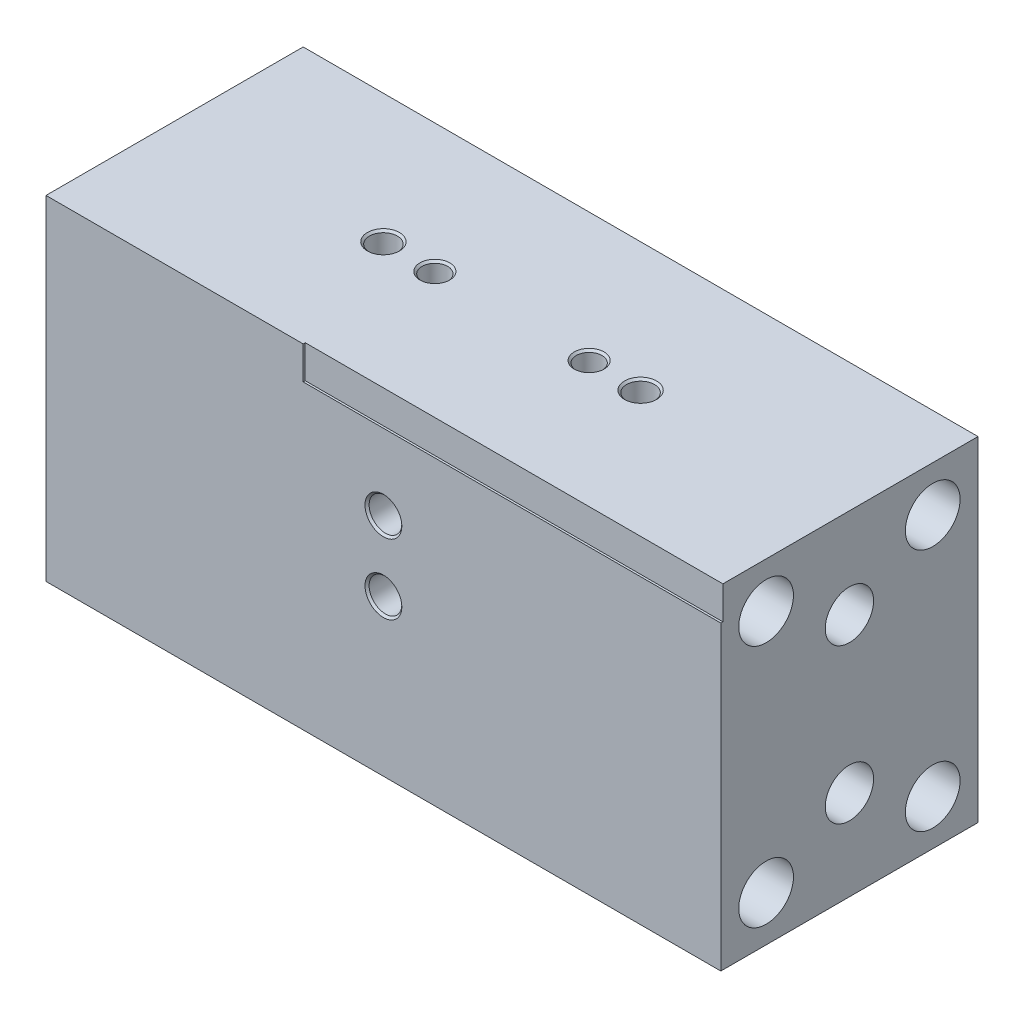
ISO-10303-21;
HEADER;
FILE_DESCRIPTION(('STEP AP214'),'2;1');
FILE_NAME('part.step','',(''),(''),'','','');
FILE_SCHEMA(('AUTOMOTIVE_DESIGN { 1 0 10303 214 1 1 1 1 }'));
ENDSEC;
DATA;
#1=APPLICATION_CONTEXT('core data for automotive mechanical design processes');
#2=APPLICATION_PROTOCOL_DEFINITION('international standard','automotive_design',2000,#1);
#3=PRODUCT_CONTEXT('',#1,'mechanical');
#4=PRODUCT('Part','Part','',(#3));
#5=PRODUCT_RELATED_PRODUCT_CATEGORY('part','',(#4));
#6=PRODUCT_DEFINITION_FORMATION('','',#4);
#7=PRODUCT_DEFINITION_CONTEXT('part definition',#1,'design');
#8=PRODUCT_DEFINITION('design','',#6,#7);
#9=PRODUCT_DEFINITION_SHAPE('','',#8);
#10=(LENGTH_UNIT() NAMED_UNIT(*) SI_UNIT(.MILLI.,.METRE.));
#11=(NAMED_UNIT(*) PLANE_ANGLE_UNIT() SI_UNIT($,.RADIAN.));
#12=(NAMED_UNIT(*) SI_UNIT($,.STERADIAN.) SOLID_ANGLE_UNIT());
#13=UNCERTAINTY_MEASURE_WITH_UNIT(LENGTH_MEASURE(1.E-05),#10,'distance_accuracy_value','');
#14=(GEOMETRIC_REPRESENTATION_CONTEXT(3) GLOBAL_UNCERTAINTY_ASSIGNED_CONTEXT((#13)) GLOBAL_UNIT_ASSIGNED_CONTEXT((#10,
#11,#12)) REPRESENTATION_CONTEXT('',''));
#15=CARTESIAN_POINT('',(0.,0.,0.));
#16=DIRECTION('',(0.,0.,1.));
#17=DIRECTION('',(1.,0.,0.));
#18=AXIS2_PLACEMENT_3D('',#15,#16,#17);
#19=CARTESIAN_POINT('',(-41.656,20.6375,15.875));
#20=DIRECTION('',(1.,0.,0.));
#21=DIRECTION('',(0.,0.,-1.));
#22=AXIS2_PLACEMENT_3D('',#19,#20,#21);
#23=PLANE('',#22);
#24=CARTESIAN_POINT('',(-41.656,-9.525,0.));
#25=DIRECTION('',(1.,0.,0.));
#26=DIRECTION('',(0.,0.,-1.));
#27=AXIS2_PLACEMENT_3D('',#24,#25,#26);
#28=CIRCLE('',#27,2.9845);
#29=CARTESIAN_POINT('',(-41.656,-9.525,-2.9845));
#30=VERTEX_POINT('',#29);
#31=EDGE_CURVE('E451',#30,#30,#28,.T.);
#32=ORIENTED_EDGE('',*,*,#31,.T.);
#33=EDGE_LOOP('',(#32));
#34=FACE_BOUND('',#33,.T.);
#35=CARTESIAN_POINT('',(-41.656,9.525,0.));
#36=DIRECTION('',(1.,0.,0.));
#37=DIRECTION('',(0.,0.,-1.));
#38=AXIS2_PLACEMENT_3D('',#35,#36,#37);
#39=CIRCLE('',#38,2.9845);
#40=CARTESIAN_POINT('',(-41.656,9.525,-2.9845));
#41=VERTEX_POINT('',#40);
#42=EDGE_CURVE('E221',#41,#41,#39,.T.);
#43=ORIENTED_EDGE('',*,*,#42,.T.);
#44=EDGE_LOOP('',(#43));
#45=FACE_BOUND('',#44,.T.);
#46=CARTESIAN_POINT('',(-41.656,-15.0495,-10.287));
#47=DIRECTION('',(1.,0.,0.));
#48=DIRECTION('',(0.,0.,-1.));
#49=AXIS2_PLACEMENT_3D('',#46,#47,#48);
#50=CIRCLE('',#49,3.3782);
#51=CARTESIAN_POINT('',(-41.656,-15.0495,-13.6652));
#52=VERTEX_POINT('',#51);
#53=EDGE_CURVE('E246',#52,#52,#50,.T.);
#54=ORIENTED_EDGE('',*,*,#53,.T.);
#55=EDGE_LOOP('',(#54));
#56=FACE_BOUND('',#55,.T.);
#57=CARTESIAN_POINT('',(-41.656,-15.0495,10.287));
#58=DIRECTION('',(1.,0.,0.));
#59=DIRECTION('',(0.,0.,-1.));
#60=AXIS2_PLACEMENT_3D('',#57,#58,#59);
#61=CIRCLE('',#60,3.3782);
#62=CARTESIAN_POINT('',(-41.656,-15.0495,6.9088));
#63=VERTEX_POINT('',#62);
#64=EDGE_CURVE('E493',#63,#63,#61,.T.);
#65=ORIENTED_EDGE('',*,*,#64,.T.);
#66=EDGE_LOOP('',(#65));
#67=FACE_BOUND('',#66,.T.);
#68=CARTESIAN_POINT('',(-41.656,15.0495,-10.287));
#69=DIRECTION('',(1.,0.,0.));
#70=DIRECTION('',(0.,0.,-1.));
#71=AXIS2_PLACEMENT_3D('',#68,#69,#70);
#72=CIRCLE('',#71,3.3782);
#73=CARTESIAN_POINT('',(-41.656,15.0495,-13.6652));
#74=VERTEX_POINT('',#73);
#75=EDGE_CURVE('E488',#74,#74,#72,.T.);
#76=ORIENTED_EDGE('',*,*,#75,.T.);
#77=EDGE_LOOP('',(#76));
#78=FACE_BOUND('',#77,.T.);
#79=CARTESIAN_POINT('',(-41.656,15.0495,10.287));
#80=DIRECTION('',(1.,0.,0.));
#81=DIRECTION('',(0.,0.,-1.));
#82=AXIS2_PLACEMENT_3D('',#79,#80,#81);
#83=CIRCLE('',#82,3.3782);
#84=CARTESIAN_POINT('',(-41.656,15.0495,6.9088));
#85=VERTEX_POINT('',#84);
#86=EDGE_CURVE('E140',#85,#85,#83,.T.);
#87=ORIENTED_EDGE('',*,*,#86,.T.);
#88=EDGE_LOOP('',(#87));
#89=FACE_BOUND('',#88,.T.);
#90=DIRECTION('',(0.,-1.,0.));
#91=VECTOR('',#90,1.);
#92=CARTESIAN_POINT('',(-41.656,20.6375,-15.875));
#93=LINE('',#92,#91);
#94=CARTESIAN_POINT('',(-41.656,20.6375,-15.875));
#95=VERTEX_POINT('',#94);
#96=CARTESIAN_POINT('',(-41.656,-20.6375,-15.875));
#97=VERTEX_POINT('',#96);
#98=EDGE_CURVE('E184',#95,#97,#93,.T.);
#99=ORIENTED_EDGE('',*,*,#98,.T.);
#100=DIRECTION('',(0.,0.,-1.));
#101=VECTOR('',#100,1.);
#102=CARTESIAN_POINT('',(-41.656,-20.6375,15.875));
#103=LINE('',#102,#101);
#104=CARTESIAN_POINT('',(-41.656,-20.6375,15.875));
#105=VERTEX_POINT('',#104);
#106=EDGE_CURVE('E210',#105,#97,#103,.T.);
#107=ORIENTED_EDGE('',*,*,#106,.F.);
#108=DIRECTION('',(0.,-1.,0.));
#109=VECTOR('',#108,1.);
#110=CARTESIAN_POINT('',(-41.656,20.6375,15.875));
#111=LINE('',#110,#109);
#112=CARTESIAN_POINT('',(-41.656,20.6375,15.875));
#113=VERTEX_POINT('',#112);
#114=EDGE_CURVE('E188',#113,#105,#111,.T.);
#115=ORIENTED_EDGE('',*,*,#114,.F.);
#116=DIRECTION('',(0.,0.,-1.));
#117=VECTOR('',#116,1.);
#118=CARTESIAN_POINT('',(-41.656,20.6375,15.875));
#119=LINE('',#118,#117);
#120=EDGE_CURVE('E195',#113,#95,#119,.T.);
#121=ORIENTED_EDGE('',*,*,#120,.T.);
#122=EDGE_LOOP('',(#99,#107,#115,#121));
#123=FACE_BOUND('',#122,.T.);
#124=ADVANCED_FACE('F37',(#34,#45,#56,#67,#78,#89,#123),#23,.F.);
#125=CARTESIAN_POINT('',(-41.656,-20.6375,15.875));
#126=DIRECTION('',(0.,1.,0.));
#127=DIRECTION('',(0.,0.,1.));
#128=AXIS2_PLACEMENT_3D('',#125,#126,#127);
#129=PLANE('',#128);
#130=DIRECTION('',(1.,0.,0.));
#131=VECTOR('',#130,1.);
#132=CARTESIAN_POINT('',(-41.656,-20.6375,-15.875));
#133=LINE('',#132,#131);
#134=CARTESIAN_POINT('',(41.656,-20.6375,-15.875));
#135=VERTEX_POINT('',#134);
#136=EDGE_CURVE('E198',#97,#135,#133,.T.);
#137=ORIENTED_EDGE('',*,*,#136,.T.);
#138=DIRECTION('',(0.,0.,-1.));
#139=VECTOR('',#138,1.);
#140=CARTESIAN_POINT('',(41.656,-20.6375,15.875));
#141=LINE('',#140,#139);
#142=CARTESIAN_POINT('',(41.656,-20.6375,15.875));
#143=VERTEX_POINT('',#142);
#144=EDGE_CURVE('E207',#143,#135,#141,.T.);
#145=ORIENTED_EDGE('',*,*,#144,.F.);
#146=DIRECTION('',(1.,0.,0.));
#147=VECTOR('',#146,1.);
#148=CARTESIAN_POINT('',(-41.656,-20.6375,15.875));
#149=LINE('',#148,#147);
#150=EDGE_CURVE('E86',#105,#143,#149,.T.);
#151=ORIENTED_EDGE('',*,*,#150,.F.);
#152=ORIENTED_EDGE('',*,*,#106,.T.);
#153=EDGE_LOOP('',(#137,#145,#151,#152));
#154=FACE_BOUND('',#153,.T.);
#155=ADVANCED_FACE('F279',(#154),#129,.F.);
#156=CARTESIAN_POINT('',(41.656,-20.6375,15.875));
#157=DIRECTION('',(-1.,0.,0.));
#158=DIRECTION('',(0.,0.,1.));
#159=AXIS2_PLACEMENT_3D('',#156,#157,#158);
#160=PLANE('',#159);
#161=CARTESIAN_POINT('',(41.656,-9.525,0.));
#162=DIRECTION('',(1.,0.,0.));
#163=DIRECTION('',(0.,0.,-1.));
#164=AXIS2_PLACEMENT_3D('',#161,#162,#163);
#165=CIRCLE('',#164,2.9845);
#166=CARTESIAN_POINT('',(41.656,-9.525,-2.9845));
#167=VERTEX_POINT('',#166);
#168=EDGE_CURVE('E453',#167,#167,#165,.T.);
#169=ORIENTED_EDGE('',*,*,#168,.F.);
#170=EDGE_LOOP('',(#169));
#171=FACE_BOUND('',#170,.T.);
#172=CARTESIAN_POINT('',(41.656,9.525,0.));
#173=DIRECTION('',(1.,0.,0.));
#174=DIRECTION('',(0.,0.,-1.));
#175=AXIS2_PLACEMENT_3D('',#172,#173,#174);
#176=CIRCLE('',#175,2.9845);
#177=CARTESIAN_POINT('',(41.656,9.525,-2.9845));
#178=VERTEX_POINT('',#177);
#179=EDGE_CURVE('E244',#178,#178,#176,.T.);
#180=ORIENTED_EDGE('',*,*,#179,.F.);
#181=EDGE_LOOP('',(#180));
#182=FACE_BOUND('',#181,.T.);
#183=CARTESIAN_POINT('',(41.656,-15.0495,-10.287));
#184=DIRECTION('',(1.,0.,0.));
#185=DIRECTION('',(0.,0.,-1.));
#186=AXIS2_PLACEMENT_3D('',#183,#184,#185);
#187=CIRCLE('',#186,3.3782);
#188=CARTESIAN_POINT('',(41.656,-15.0495,-13.6652));
#189=VERTEX_POINT('',#188);
#190=EDGE_CURVE('E243',#189,#189,#187,.T.);
#191=ORIENTED_EDGE('',*,*,#190,.F.);
#192=EDGE_LOOP('',(#191));
#193=FACE_BOUND('',#192,.T.);
#194=CARTESIAN_POINT('',(41.656,-15.0495,10.287));
#195=DIRECTION('',(1.,0.,0.));
#196=DIRECTION('',(0.,0.,-1.));
#197=AXIS2_PLACEMENT_3D('',#194,#195,#196);
#198=CIRCLE('',#197,3.3782);
#199=CARTESIAN_POINT('',(41.656,-15.0495,6.9088));
#200=VERTEX_POINT('',#199);
#201=EDGE_CURVE('E467',#200,#200,#198,.T.);
#202=ORIENTED_EDGE('',*,*,#201,.F.);
#203=EDGE_LOOP('',(#202));
#204=FACE_BOUND('',#203,.T.);
#205=CARTESIAN_POINT('',(41.656,15.0495,-10.287));
#206=DIRECTION('',(1.,0.,0.));
#207=DIRECTION('',(0.,0.,-1.));
#208=AXIS2_PLACEMENT_3D('',#205,#206,#207);
#209=CIRCLE('',#208,3.3782);
#210=CARTESIAN_POINT('',(41.656,15.0495,-13.6652));
#211=VERTEX_POINT('',#210);
#212=EDGE_CURVE('E471',#211,#211,#209,.T.);
#213=ORIENTED_EDGE('',*,*,#212,.F.);
#214=EDGE_LOOP('',(#213));
#215=FACE_BOUND('',#214,.T.);
#216=CARTESIAN_POINT('',(41.656,15.0495,10.287));
#217=DIRECTION('',(1.,0.,0.));
#218=DIRECTION('',(0.,0.,-1.));
#219=AXIS2_PLACEMENT_3D('',#216,#217,#218);
#220=CIRCLE('',#219,3.3782);
#221=CARTESIAN_POINT('',(41.656,15.0495,6.9088));
#222=VERTEX_POINT('',#221);
#223=EDGE_CURVE('E146',#222,#222,#220,.T.);
#224=ORIENTED_EDGE('',*,*,#223,.F.);
#225=EDGE_LOOP('',(#224));
#226=FACE_BOUND('',#225,.T.);
#227=DIRECTION('',(0.,0.,-1.));
#228=VECTOR('',#227,1.);
#229=CARTESIAN_POINT('',(41.656,20.6375,15.875));
#230=LINE('',#229,#228);
#231=CARTESIAN_POINT('',(41.656,20.6375,15.621));
#232=VERTEX_POINT('',#231);
#233=CARTESIAN_POINT('',(41.656,20.6375,-15.875));
#234=VERTEX_POINT('',#233);
#235=EDGE_CURVE('E205',#232,#234,#230,.T.);
#236=ORIENTED_EDGE('',*,*,#235,.F.);
#237=DIRECTION('',(0.,1.,0.));
#238=VECTOR('',#237,1.);
#239=CARTESIAN_POINT('',(41.656,16.5735,15.621));
#240=LINE('',#239,#238);
#241=CARTESIAN_POINT('',(41.656,16.5735,15.621));
#242=VERTEX_POINT('',#241);
#243=EDGE_CURVE('E170',#242,#232,#240,.T.);
#244=ORIENTED_EDGE('',*,*,#243,.F.);
#245=DIRECTION('',(0.,0.,-1.));
#246=VECTOR('',#245,1.);
#247=CARTESIAN_POINT('',(41.656,16.5735,15.875));
#248=LINE('',#247,#246);
#249=CARTESIAN_POINT('',(41.656,16.5735,15.875));
#250=VERTEX_POINT('',#249);
#251=EDGE_CURVE('E167',#250,#242,#248,.T.);
#252=ORIENTED_EDGE('',*,*,#251,.F.);
#253=DIRECTION('',(0.,1.,0.));
#254=VECTOR('',#253,1.);
#255=CARTESIAN_POINT('',(41.656,-20.6375,15.875));
#256=LINE('',#255,#254);
#257=EDGE_CURVE('E191',#143,#250,#256,.T.);
#258=ORIENTED_EDGE('',*,*,#257,.F.);
#259=ORIENTED_EDGE('',*,*,#144,.T.);
#260=DIRECTION('',(0.,1.,0.));
#261=VECTOR('',#260,1.);
#262=CARTESIAN_POINT('',(41.656,-20.6375,-15.875));
#263=LINE('',#262,#261);
#264=EDGE_CURVE('E200',#135,#234,#263,.T.);
#265=ORIENTED_EDGE('',*,*,#264,.T.);
#266=EDGE_LOOP('',(#236,#244,#252,#258,#259,#265));
#267=FACE_BOUND('',#266,.T.);
#268=ADVANCED_FACE('F275',(#171,#182,#193,#204,#215,#226,#267),#160,.F.);
#269=CARTESIAN_POINT('',(41.656,20.6375,15.875));
#270=DIRECTION('',(0.,-1.,0.));
#271=DIRECTION('',(1.,0.,0.));
#272=AXIS2_PLACEMENT_3D('',#269,#270,#271);
#273=PLANE('',#272);
#274=CARTESIAN_POINT('',(15.875,20.6375,0.));
#275=DIRECTION('',(0.,-1.,0.));
#276=DIRECTION('',(1.,0.,0.));
#277=AXIS2_PLACEMENT_3D('',#274,#275,#276);
#278=CIRCLE('',#277,1.9812);
#279=CARTESIAN_POINT('',(17.8562,20.6375,0.));
#280=VERTEX_POINT('',#279);
#281=EDGE_CURVE('E333',#280,#280,#278,.T.);
#282=ORIENTED_EDGE('',*,*,#281,.T.);
#283=EDGE_LOOP('',(#282));
#284=FACE_BOUND('',#283,.T.);
#285=CARTESIAN_POINT('',(9.525,20.6375,0.));
#286=DIRECTION('',(0.,-1.,0.));
#287=DIRECTION('',(1.,0.,0.));
#288=AXIS2_PLACEMENT_3D('',#285,#286,#287);
#289=CIRCLE('',#288,1.84150000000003);
#290=CARTESIAN_POINT('',(11.3665,20.6375,0.));
#291=VERTEX_POINT('',#290);
#292=EDGE_CURVE('E338',#291,#291,#289,.T.);
#293=ORIENTED_EDGE('',*,*,#292,.T.);
#294=EDGE_LOOP('',(#293));
#295=FACE_BOUND('',#294,.T.);
#296=CARTESIAN_POINT('',(-9.525,20.6375,0.));
#297=DIRECTION('',(0.,-1.,0.));
#298=DIRECTION('',(1.,0.,0.));
#299=AXIS2_PLACEMENT_3D('',#296,#297,#298);
#300=CIRCLE('',#299,1.84150000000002);
#301=CARTESIAN_POINT('',(-7.68349999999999,20.6375,0.));
#302=VERTEX_POINT('',#301);
#303=EDGE_CURVE('E327',#302,#302,#300,.T.);
#304=ORIENTED_EDGE('',*,*,#303,.T.);
#305=EDGE_LOOP('',(#304));
#306=FACE_BOUND('',#305,.T.);
#307=CARTESIAN_POINT('',(-15.875,20.6375,0.));
#308=DIRECTION('',(0.,-1.,0.));
#309=DIRECTION('',(1.,0.,0.));
#310=AXIS2_PLACEMENT_3D('',#307,#308,#309);
#311=CIRCLE('',#310,1.98120000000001);
#312=CARTESIAN_POINT('',(-13.8938,20.6375,0.));
#313=VERTEX_POINT('',#312);
#314=EDGE_CURVE('E342',#313,#313,#311,.T.);
#315=ORIENTED_EDGE('',*,*,#314,.T.);
#316=EDGE_LOOP('',(#315));
#317=FACE_BOUND('',#316,.T.);
#318=DIRECTION('',(0.,0.,1.));
#319=VECTOR('',#318,1.);
#320=CARTESIAN_POINT('',(-9.906,20.6375,15.621));
#321=LINE('',#320,#319);
#322=CARTESIAN_POINT('',(-9.906,20.6375,15.621));
#323=VERTEX_POINT('',#322);
#324=CARTESIAN_POINT('',(-9.906,20.6375,15.875));
#325=VERTEX_POINT('',#324);
#326=EDGE_CURVE('E52',#323,#325,#321,.T.);
#327=ORIENTED_EDGE('',*,*,#326,.F.);
#328=DIRECTION('',(1.,0.,0.));
#329=VECTOR('',#328,1.);
#330=CARTESIAN_POINT('',(-9.906,20.6375,15.621));
#331=LINE('',#330,#329);
#332=EDGE_CURVE('E181',#323,#232,#331,.T.);
#333=ORIENTED_EDGE('',*,*,#332,.T.);
#334=ORIENTED_EDGE('',*,*,#235,.T.);
#335=DIRECTION('',(-1.,0.,0.));
#336=VECTOR('',#335,1.);
#337=CARTESIAN_POINT('',(41.656,20.6375,-15.875));
#338=LINE('',#337,#336);
#339=EDGE_CURVE('E80',#234,#95,#338,.T.);
#340=ORIENTED_EDGE('',*,*,#339,.T.);
#341=ORIENTED_EDGE('',*,*,#120,.F.);
#342=DIRECTION('',(-1.,0.,0.));
#343=VECTOR('',#342,1.);
#344=CARTESIAN_POINT('',(41.656,20.6375,15.875));
#345=LINE('',#344,#343);
#346=EDGE_CURVE('E60',#325,#113,#345,.T.);
#347=ORIENTED_EDGE('',*,*,#346,.F.);
#348=EDGE_LOOP('',(#327,#333,#334,#340,#341,#347));
#349=FACE_BOUND('',#348,.T.);
#350=ADVANCED_FACE('F268',(#284,#295,#306,#317,#349),#273,.F.);
#351=CARTESIAN_POINT('',(-41.656,-20.6375,15.875));
#352=DIRECTION('',(0.,0.,1.));
#353=DIRECTION('',(1.,0.,0.));
#354=AXIS2_PLACEMENT_3D('',#351,#352,#353);
#355=PLANE('',#354);
#356=CARTESIAN_POINT('',(0.,-1.397,15.875));
#357=DIRECTION('',(0.,0.,1.));
#358=DIRECTION('',(1.,0.,0.));
#359=AXIS2_PLACEMENT_3D('',#356,#357,#358);
#360=CIRCLE('',#359,2.27329999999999);
#361=CARTESIAN_POINT('',(2.2733,-1.397,15.875));
#362=VERTEX_POINT('',#361);
#363=EDGE_CURVE('E351',#362,#362,#360,.F.);
#364=ORIENTED_EDGE('',*,*,#363,.T.);
#365=EDGE_LOOP('',(#364));
#366=FACE_BOUND('',#365,.T.);
#367=CARTESIAN_POINT('',(0.,7.239,15.875));
#368=DIRECTION('',(0.,0.,1.));
#369=DIRECTION('',(1.,0.,0.));
#370=AXIS2_PLACEMENT_3D('',#367,#368,#369);
#371=CIRCLE('',#370,2.27329999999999);
#372=CARTESIAN_POINT('',(2.2733,7.239,15.875));
#373=VERTEX_POINT('',#372);
#374=EDGE_CURVE('E354',#373,#373,#371,.F.);
#375=ORIENTED_EDGE('',*,*,#374,.T.);
#376=EDGE_LOOP('',(#375));
#377=FACE_BOUND('',#376,.T.);
#378=DIRECTION('',(1.,0.,0.));
#379=VECTOR('',#378,1.);
#380=CARTESIAN_POINT('',(-9.906,16.5735,15.875));
#381=LINE('',#380,#379);
#382=CARTESIAN_POINT('',(-9.906,16.5735,15.875));
#383=VERTEX_POINT('',#382);
#384=EDGE_CURVE('E177',#383,#250,#381,.T.);
#385=ORIENTED_EDGE('',*,*,#384,.F.);
#386=DIRECTION('',(0.,-1.,0.));
#387=VECTOR('',#386,1.);
#388=CARTESIAN_POINT('',(-9.906,20.6375,15.875));
#389=LINE('',#388,#387);
#390=EDGE_CURVE('E169',#325,#383,#389,.T.);
#391=ORIENTED_EDGE('',*,*,#390,.F.);
#392=ORIENTED_EDGE('',*,*,#346,.T.);
#393=ORIENTED_EDGE('',*,*,#114,.T.);
#394=ORIENTED_EDGE('',*,*,#150,.T.);
#395=ORIENTED_EDGE('',*,*,#257,.T.);
#396=EDGE_LOOP('',(#385,#391,#392,#393,#394,#395));
#397=FACE_BOUND('',#396,.T.);
#398=ADVANCED_FACE('F265',(#366,#377,#397),#355,.T.);
#399=CARTESIAN_POINT('',(-41.656,-20.6375,-15.875));
#400=DIRECTION('',(0.,0.,1.));
#401=DIRECTION('',(1.,0.,0.));
#402=AXIS2_PLACEMENT_3D('',#399,#400,#401);
#403=PLANE('',#402);
#404=CARTESIAN_POINT('',(-15.875,0.,-15.875));
#405=DIRECTION('',(0.,0.,1.));
#406=DIRECTION('',(1.,0.,0.));
#407=AXIS2_PLACEMENT_3D('',#404,#405,#406);
#408=CIRCLE('',#407,1.98119999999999);
#409=CARTESIAN_POINT('',(-13.8938,0.,-15.875));
#410=VERTEX_POINT('',#409);
#411=EDGE_CURVE('E369',#410,#410,#408,.T.);
#412=ORIENTED_EDGE('',*,*,#411,.T.);
#413=EDGE_LOOP('',(#412));
#414=FACE_BOUND('',#413,.T.);
#415=CARTESIAN_POINT('',(-9.525,0.,-15.875));
#416=DIRECTION('',(0.,0.,1.));
#417=DIRECTION('',(1.,0.,0.));
#418=AXIS2_PLACEMENT_3D('',#415,#416,#417);
#419=CIRCLE('',#418,1.8415);
#420=CARTESIAN_POINT('',(-7.6835,0.,-15.875));
#421=VERTEX_POINT('',#420);
#422=EDGE_CURVE('E372',#421,#421,#419,.T.);
#423=ORIENTED_EDGE('',*,*,#422,.T.);
#424=EDGE_LOOP('',(#423));
#425=FACE_BOUND('',#424,.T.);
#426=CARTESIAN_POINT('',(9.525,0.,-15.875));
#427=DIRECTION('',(0.,0.,1.));
#428=DIRECTION('',(1.,0.,0.));
#429=AXIS2_PLACEMENT_3D('',#426,#427,#428);
#430=CIRCLE('',#429,1.8415);
#431=CARTESIAN_POINT('',(11.3665,0.,-15.875));
#432=VERTEX_POINT('',#431);
#433=EDGE_CURVE('E375',#432,#432,#430,.T.);
#434=ORIENTED_EDGE('',*,*,#433,.T.);
#435=EDGE_LOOP('',(#434));
#436=FACE_BOUND('',#435,.T.);
#437=CARTESIAN_POINT('',(15.875,0.,-15.875));
#438=DIRECTION('',(0.,0.,1.));
#439=DIRECTION('',(1.,0.,0.));
#440=AXIS2_PLACEMENT_3D('',#437,#438,#439);
#441=CIRCLE('',#440,1.98119999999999);
#442=CARTESIAN_POINT('',(17.8562,0.,-15.875));
#443=VERTEX_POINT('',#442);
#444=EDGE_CURVE('E377',#443,#443,#441,.T.);
#445=ORIENTED_EDGE('',*,*,#444,.T.);
#446=EDGE_LOOP('',(#445));
#447=FACE_BOUND('',#446,.T.);
#448=ORIENTED_EDGE('',*,*,#98,.F.);
#449=ORIENTED_EDGE('',*,*,#339,.F.);
#450=ORIENTED_EDGE('',*,*,#264,.F.);
#451=ORIENTED_EDGE('',*,*,#136,.F.);
#452=EDGE_LOOP('',(#448,#449,#450,#451));
#453=FACE_BOUND('',#452,.T.);
#454=ADVANCED_FACE('F260',(#414,#425,#436,#447,#453),#403,.F.);
#455=CARTESIAN_POINT('',(-9.906,16.5735,15.621));
#456=DIRECTION('',(0.,0.,-1.));
#457=DIRECTION('',(-1.,0.,0.));
#458=AXIS2_PLACEMENT_3D('',#455,#456,#457);
#459=PLANE('',#458);
#460=ORIENTED_EDGE('',*,*,#243,.T.);
#461=ORIENTED_EDGE('',*,*,#332,.F.);
#462=DIRECTION('',(0.,1.,0.));
#463=VECTOR('',#462,1.);
#464=CARTESIAN_POINT('',(-9.906,16.5735,15.621));
#465=LINE('',#464,#463);
#466=CARTESIAN_POINT('',(-9.906,16.5735,15.621));
#467=VERTEX_POINT('',#466);
#468=EDGE_CURVE('E175',#467,#323,#465,.T.);
#469=ORIENTED_EDGE('',*,*,#468,.F.);
#470=DIRECTION('',(1.,0.,0.));
#471=VECTOR('',#470,1.);
#472=CARTESIAN_POINT('',(-9.906,16.5735,15.621));
#473=LINE('',#472,#471);
#474=EDGE_CURVE('E185',#467,#242,#473,.T.);
#475=ORIENTED_EDGE('',*,*,#474,.T.);
#476=EDGE_LOOP('',(#460,#461,#469,#475));
#477=FACE_BOUND('',#476,.T.);
#478=ADVANCED_FACE('F257',(#477),#459,.F.);
#479=CARTESIAN_POINT('',(-9.906,16.5735,15.875));
#480=DIRECTION('',(0.,-1.,0.));
#481=DIRECTION('',(0.,0.,-1.));
#482=AXIS2_PLACEMENT_3D('',#479,#480,#481);
#483=PLANE('',#482);
#484=ORIENTED_EDGE('',*,*,#251,.T.);
#485=ORIENTED_EDGE('',*,*,#474,.F.);
#486=DIRECTION('',(0.,0.,-1.));
#487=VECTOR('',#486,1.);
#488=CARTESIAN_POINT('',(-9.906,16.5735,15.875));
#489=LINE('',#488,#487);
#490=EDGE_CURVE('E172',#383,#467,#489,.T.);
#491=ORIENTED_EDGE('',*,*,#490,.F.);
#492=ORIENTED_EDGE('',*,*,#384,.T.);
#493=EDGE_LOOP('',(#484,#485,#491,#492));
#494=FACE_BOUND('',#493,.T.);
#495=ADVANCED_FACE('F256',(#494),#483,.F.);
#496=CARTESIAN_POINT('',(-9.906,20.6375,15.875));
#497=DIRECTION('',(1.,0.,0.));
#498=DIRECTION('',(0.,0.,-1.));
#499=AXIS2_PLACEMENT_3D('',#496,#497,#498);
#500=PLANE('',#499);
#501=ORIENTED_EDGE('',*,*,#326,.T.);
#502=ORIENTED_EDGE('',*,*,#390,.T.);
#503=ORIENTED_EDGE('',*,*,#490,.T.);
#504=ORIENTED_EDGE('',*,*,#468,.T.);
#505=EDGE_LOOP('',(#501,#502,#503,#504));
#506=FACE_BOUND('',#505,.T.);
#507=ADVANCED_FACE('F252',(#506),#500,.T.);
#508=CARTESIAN_POINT('',(15.875,20.6375,0.));
#509=DIRECTION('',(0.,1.,0.));
#510=DIRECTION('',(0.,0.,1.));
#511=AXIS2_PLACEMENT_3D('',#508,#509,#510);
#512=CYLINDRICAL_SURFACE('',#511,1.7272);
#513=CARTESIAN_POINT('',(15.875,20.3835,0.));
#514=DIRECTION('',(0.,-1.,0.));
#515=DIRECTION('',(0.,0.,-1.));
#516=AXIS2_PLACEMENT_3D('',#513,#514,#515);
#517=CIRCLE('',#516,1.7272);
#518=CARTESIAN_POINT('',(15.875,20.3835,-1.7272));
#519=VERTEX_POINT('',#518);
#520=EDGE_CURVE('E345',#519,#519,#517,.F.);
#521=ORIENTED_EDGE('',*,*,#520,.T.);
#522=EDGE_LOOP('',(#521));
#523=FACE_BOUND('',#522,.T.);
#524=CARTESIAN_POINT('',(15.875,11.9589310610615,1.7272));
#525=CARTESIAN_POINT('',(15.7873615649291,11.9589320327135,1.7271995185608));
#526=CARTESIAN_POINT('',(15.6997191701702,11.9637357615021,1.72048836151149));
#527=CARTESIAN_POINT('',(15.527332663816,11.982135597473,1.69409867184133));
#528=CARTESIAN_POINT('',(15.4425916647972,11.9957408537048,1.67440664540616));
#529=CARTESIAN_POINT('',(15.278843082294,12.0296011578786,1.62330969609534));
#530=CARTESIAN_POINT('',(15.1998014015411,12.0498118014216,1.5919828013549));
#531=CARTESIAN_POINT('',(15.0481321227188,12.0945267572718,1.51875274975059));
#532=CARTESIAN_POINT('',(14.9755065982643,12.1190324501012,1.47684619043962));
#533=CARTESIAN_POINT('',(14.8297304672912,12.1729262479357,1.37812578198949));
#534=CARTESIAN_POINT('',(14.7574459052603,12.2025532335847,1.32016319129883));
#535=CARTESIAN_POINT('',(14.6229150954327,12.2614351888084,1.19333842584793));
#536=CARTESIAN_POINT('',(14.5606756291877,12.2906898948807,1.1244689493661));
#537=CARTESIAN_POINT('',(14.4419744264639,12.3489424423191,0.969577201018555));
#538=CARTESIAN_POINT('',(14.3866782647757,12.3776336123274,0.882535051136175));
#539=CARTESIAN_POINT('',(14.2919214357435,12.4281966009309,0.698407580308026));
#540=CARTESIAN_POINT('',(14.2524473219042,12.4500742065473,0.601330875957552));
#541=CARTESIAN_POINT('',(14.1942359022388,12.482780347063,0.409148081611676));
#542=CARTESIAN_POINT('',(14.1739492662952,12.4944275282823,0.31465409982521));
#543=CARTESIAN_POINT('',(14.1494813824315,12.5085094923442,0.122955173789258));
#544=CARTESIAN_POINT('',(14.1452863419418,12.5109521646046,0.0257526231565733));
#545=CARTESIAN_POINT('',(14.1527714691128,12.5066255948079,-0.156502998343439));
#546=CARTESIAN_POINT('',(14.1626724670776,12.5008886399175,-0.241661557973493));
#547=CARTESIAN_POINT('',(14.1947326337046,12.482557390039,-0.408860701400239));
#548=CARTESIAN_POINT('',(14.2168927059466,12.4699625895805,-0.490901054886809));
#549=CARTESIAN_POINT('',(14.2727307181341,12.4388885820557,-0.650512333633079));
#550=CARTESIAN_POINT('',(14.3065011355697,12.4203622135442,-0.728041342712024));
#551=CARTESIAN_POINT('',(14.3843361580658,12.3789471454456,-0.876453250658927));
#552=CARTESIAN_POINT('',(14.428403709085,12.356057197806,-0.947334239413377));
#553=CARTESIAN_POINT('',(14.5313081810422,12.3048041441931,-1.08914861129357));
#554=CARTESIAN_POINT('',(14.5912595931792,12.2761143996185,-1.15915478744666));
#555=CARTESIAN_POINT('',(14.7213397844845,12.2178734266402,-1.28869275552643));
#556=CARTESIAN_POINT('',(14.7914812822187,12.1883211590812,-1.34821124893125));
#557=CARTESIAN_POINT('',(14.9486216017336,12.1281496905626,-1.4612877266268));
#558=CARTESIAN_POINT('',(15.0366142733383,12.0977376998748,-1.51358736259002));
#559=CARTESIAN_POINT('',(15.2220726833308,12.0434405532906,-1.6023177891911));
#560=CARTESIAN_POINT('',(15.3195210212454,12.0195437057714,-1.63877707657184));
#561=CARTESIAN_POINT('',(15.4976883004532,11.9868304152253,-1.68738823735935));
#562=CARTESIAN_POINT('',(15.5769938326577,11.9757947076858,-1.70322972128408));
#563=CARTESIAN_POINT('',(15.7377030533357,11.9614919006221,-1.72363336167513));
#564=CARTESIAN_POINT('',(15.8191045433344,11.9582169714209,-1.72820688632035));
#565=CARTESIAN_POINT('',(15.9817063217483,11.9599103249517,-1.72581940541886));
#566=CARTESIAN_POINT('',(16.0629064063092,11.9648849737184,-1.71884949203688));
#567=CARTESIAN_POINT('',(16.2227477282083,11.982359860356,-1.69376739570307));
#568=CARTESIAN_POINT('',(16.3013870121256,11.9948657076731,-1.6756469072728));
#569=CARTESIAN_POINT('',(16.4549963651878,12.0259378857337,-1.62890639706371));
#570=CARTESIAN_POINT('',(16.5299251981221,12.0445598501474,-1.6001896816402));
#571=CARTESIAN_POINT('',(16.6741862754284,12.0858458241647,-1.53324919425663));
#572=CARTESIAN_POINT('',(16.7435162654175,12.1085114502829,-1.49502161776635));
#573=CARTESIAN_POINT('',(16.8870866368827,12.1599784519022,-1.40263103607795));
#574=CARTESIAN_POINT('',(16.960157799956,12.1891678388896,-1.34686373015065));
#575=CARTESIAN_POINT('',(17.0966091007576,12.2475988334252,-1.22446002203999));
#576=CARTESIAN_POINT('',(17.1599807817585,12.2768404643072,-1.15781423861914));
#577=CARTESIAN_POINT('',(17.282016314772,12.3357938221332,-1.00693207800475));
#578=CARTESIAN_POINT('',(17.3394487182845,12.3652203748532,-0.921576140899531));
#579=CARTESIAN_POINT('',(17.4388188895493,12.4177096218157,-0.740493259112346));
#580=CARTESIAN_POINT('',(17.4807685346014,12.4407771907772,-0.644774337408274));
#581=CARTESIAN_POINT('',(17.5443545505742,12.4762925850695,-0.453642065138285));
#582=CARTESIAN_POINT('',(17.5673440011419,12.4894405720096,-0.35881301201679));
#583=CARTESIAN_POINT('',(17.5969801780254,12.5064564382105,-0.165848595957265));
#584=CARTESIAN_POINT('',(17.6036423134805,12.5103330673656,-0.0677164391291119));
#585=CARTESIAN_POINT('',(17.6004360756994,12.5084806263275,0.11626830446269));
#586=CARTESIAN_POINT('',(17.5924662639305,12.5038547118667,0.202173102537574));
#587=CARTESIAN_POINT('',(17.5640192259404,12.487544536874,0.371181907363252));
#588=CARTESIAN_POINT('',(17.5435414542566,12.4758599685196,0.454285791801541));
#589=CARTESIAN_POINT('',(17.4910744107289,12.4465145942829,0.615376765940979));
#590=CARTESIAN_POINT('',(17.4591139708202,12.4288687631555,0.693376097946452));
#591=CARTESIAN_POINT('',(17.3848281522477,12.3890216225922,0.842983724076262));
#592=CARTESIAN_POINT('',(17.3425000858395,12.3668191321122,0.914590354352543));
#593=CARTESIAN_POINT('',(17.2434291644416,12.3168790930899,1.05783642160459));
#594=CARTESIAN_POINT('',(17.1856132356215,12.2888013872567,1.12861420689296));
#595=CARTESIAN_POINT('',(17.0598318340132,12.2314205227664,1.26003254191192));
#596=CARTESIAN_POINT('',(16.9918543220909,12.2021159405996,1.32066088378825));
#597=CARTESIAN_POINT('',(16.8387922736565,12.1417593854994,1.43685443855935));
#598=CARTESIAN_POINT('',(16.7526474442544,12.1108721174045,1.49111998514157));
#599=CARTESIAN_POINT('',(16.5706673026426,12.0549270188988,1.58419465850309));
#600=CARTESIAN_POINT('',(16.4748457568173,12.0298610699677,1.62302536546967));
#601=CARTESIAN_POINT('',(16.2952717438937,11.9937046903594,1.67737632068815));
#602=CARTESIAN_POINT('',(16.2128104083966,11.9808420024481,1.695965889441));
#603=CARTESIAN_POINT('',(16.0452317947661,11.9634596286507,1.72087073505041));
#604=CARTESIAN_POINT('',(15.9601177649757,11.9589301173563,1.72720046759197));
#605=CARTESIAN_POINT('',(15.875,11.9589310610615,1.7272));
#606=B_SPLINE_CURVE_WITH_KNOTS('',3,(#524,#525,#526,#527,#528,#529,#530,#531,#532,#533,#534,
#535,#536,#537,#538,#539,#540,#541,#542,#543,#544,#545,#546,#547,#548,#549,#550,#551,#552,#553,
#554,#555,#556,#557,#558,#559,#560,#561,#562,#563,#564,#565,#566,#567,#568,#569,#570,#571,#572,
#573,#574,#575,#576,#577,#578,#579,#580,#581,#582,#583,#584,#585,#586,#587,#588,#589,#590,#591,
#592,#593,#594,#595,#596,#597,#598,#599,#600,#601,#602,#603,#604,#605),.UNSPECIFIED.,.T.,.F.,(4,
2,2,2,2,2,2,2,2,2,2,2,2,2,2,2,2,2,2,2,2,2,2,2,2,2,2,2,2,2,2,2,2,2,2,2,2,2,2,2,4),(0.,
0.262559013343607,0.525391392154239,0.786492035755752,1.04767675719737,1.33834284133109,
1.62920434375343,1.94859630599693,2.26771625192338,2.55805080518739,2.84813644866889,
3.10468711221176,3.36125668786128,3.61991911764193,3.87865564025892,4.16708041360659,
4.4558683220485,4.77460669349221,5.0927692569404,5.33656772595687,5.58012012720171,
5.82386056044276,6.06778276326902,6.31398821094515,6.56029230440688,6.84847268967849,
7.13690291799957,7.45622940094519,7.77531040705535,8.06894708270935,8.36230652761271,
8.6202498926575,8.87820450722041,9.13551589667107,9.39289406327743,9.67856450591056,
9.96457612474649,10.2821905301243,10.5993592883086,10.8546677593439,11.1096750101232),.UNSPECIFIED.);
#607=CARTESIAN_POINT('',(15.875,11.9589310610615,1.7272));
#608=VERTEX_POINT('',#607);
#609=EDGE_CURVE('E220',#608,#608,#606,.T.);
#610=ORIENTED_EDGE('',*,*,#609,.T.);
#611=EDGE_LOOP('',(#610));
#612=FACE_BOUND('',#611,.T.);
#613=ADVANCED_FACE('F248',(#523,#612),#512,.F.);
#614=CARTESIAN_POINT('',(-15.875,20.6375,0.));
#615=DIRECTION('',(0.,1.,0.));
#616=DIRECTION('',(0.,0.,1.));
#617=AXIS2_PLACEMENT_3D('',#614,#615,#616);
#618=CYLINDRICAL_SURFACE('',#617,1.7272);
#619=CARTESIAN_POINT('',(-15.875,20.3835,0.));
#620=DIRECTION('',(0.,-1.,0.));
#621=DIRECTION('',(0.,0.,-1.));
#622=AXIS2_PLACEMENT_3D('',#619,#620,#621);
#623=CIRCLE('',#622,1.7272);
#624=CARTESIAN_POINT('',(-15.875,20.3835,-1.7272));
#625=VERTEX_POINT('',#624);
#626=EDGE_CURVE('E11',#625,#625,#623,.F.);
#627=ORIENTED_EDGE('',*,*,#626,.T.);
#628=EDGE_LOOP('',(#627));
#629=FACE_BOUND('',#628,.T.);
#630=CARTESIAN_POINT('',(-15.875,11.9589310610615,1.7272));
#631=CARTESIAN_POINT('',(-15.9626384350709,11.9589320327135,1.7271995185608));
#632=CARTESIAN_POINT('',(-16.0502808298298,11.9637357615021,1.72048836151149));
#633=CARTESIAN_POINT('',(-16.222667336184,11.982135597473,1.69409867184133));
#634=CARTESIAN_POINT('',(-16.3074083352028,11.9957408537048,1.67440664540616));
#635=CARTESIAN_POINT('',(-16.471156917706,12.0296011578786,1.62330969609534));
#636=CARTESIAN_POINT('',(-16.5501985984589,12.0498118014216,1.5919828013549));
#637=CARTESIAN_POINT('',(-16.7018678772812,12.0945267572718,1.51875274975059));
#638=CARTESIAN_POINT('',(-16.7744934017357,12.1190324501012,1.47684619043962));
#639=CARTESIAN_POINT('',(-16.9202695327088,12.1729262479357,1.37812578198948));
#640=CARTESIAN_POINT('',(-16.9925540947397,12.2025532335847,1.32016319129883));
#641=CARTESIAN_POINT('',(-17.1270849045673,12.2614351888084,1.19333842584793));
#642=CARTESIAN_POINT('',(-17.1893243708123,12.2906898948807,1.1244689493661));
#643=CARTESIAN_POINT('',(-17.3080255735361,12.3489424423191,0.969577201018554));
#644=CARTESIAN_POINT('',(-17.3633217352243,12.3776336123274,0.882535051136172));
#645=CARTESIAN_POINT('',(-17.4580785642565,12.4281966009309,0.698407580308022));
#646=CARTESIAN_POINT('',(-17.4975526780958,12.4500742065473,0.601330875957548));
#647=CARTESIAN_POINT('',(-17.5557640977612,12.482780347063,0.409148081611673));
#648=CARTESIAN_POINT('',(-17.5760507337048,12.4944275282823,0.314654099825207));
#649=CARTESIAN_POINT('',(-17.6005186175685,12.5085094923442,0.122955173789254));
#650=CARTESIAN_POINT('',(-17.6047136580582,12.5109521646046,0.0257526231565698));
#651=CARTESIAN_POINT('',(-17.5972285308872,12.5066255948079,-0.156502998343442));
#652=CARTESIAN_POINT('',(-17.5873275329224,12.5008886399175,-0.241661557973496));
#653=CARTESIAN_POINT('',(-17.5552673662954,12.482557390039,-0.408860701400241));
#654=CARTESIAN_POINT('',(-17.5331072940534,12.4699625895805,-0.490901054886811));
#655=CARTESIAN_POINT('',(-17.4772692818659,12.4388885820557,-0.650512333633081));
#656=CARTESIAN_POINT('',(-17.4434988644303,12.4203622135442,-0.728041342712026));
#657=CARTESIAN_POINT('',(-17.3656638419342,12.3789471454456,-0.876453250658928));
#658=CARTESIAN_POINT('',(-17.3215962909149,12.356057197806,-0.947334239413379));
#659=CARTESIAN_POINT('',(-17.2186918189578,12.3048041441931,-1.08914861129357));
#660=CARTESIAN_POINT('',(-17.1587404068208,12.2761143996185,-1.15915478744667));
#661=CARTESIAN_POINT('',(-17.0286602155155,12.2178734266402,-1.28869275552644));
#662=CARTESIAN_POINT('',(-16.9585187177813,12.1883211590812,-1.34821124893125));
#663=CARTESIAN_POINT('',(-16.8013783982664,12.1281496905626,-1.4612877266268));
#664=CARTESIAN_POINT('',(-16.7133857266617,12.0977376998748,-1.51358736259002));
#665=CARTESIAN_POINT('',(-16.5279273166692,12.0434405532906,-1.60231778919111));
#666=CARTESIAN_POINT('',(-16.4304789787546,12.0195437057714,-1.63877707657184));
#667=CARTESIAN_POINT('',(-16.2523116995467,11.9868304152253,-1.68738823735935));
#668=CARTESIAN_POINT('',(-16.1730061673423,11.9757947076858,-1.70322972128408));
#669=CARTESIAN_POINT('',(-16.0122969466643,11.9614919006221,-1.72363336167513));
#670=CARTESIAN_POINT('',(-15.9308954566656,11.9582169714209,-1.72820688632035));
#671=CARTESIAN_POINT('',(-15.7682936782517,11.9599103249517,-1.72581940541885));
#672=CARTESIAN_POINT('',(-15.6870935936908,11.9648849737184,-1.71884949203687));
#673=CARTESIAN_POINT('',(-15.5272522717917,11.982359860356,-1.69376739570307));
#674=CARTESIAN_POINT('',(-15.4486129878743,11.9948657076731,-1.6756469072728));
#675=CARTESIAN_POINT('',(-15.2950036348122,12.0259378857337,-1.62890639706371));
#676=CARTESIAN_POINT('',(-15.2200748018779,12.0445598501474,-1.6001896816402));
#677=CARTESIAN_POINT('',(-15.0758137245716,12.0858458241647,-1.53324919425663));
#678=CARTESIAN_POINT('',(-15.0064837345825,12.1085114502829,-1.49502161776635));
#679=CARTESIAN_POINT('',(-14.8629133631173,12.1599784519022,-1.40263103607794));
#680=CARTESIAN_POINT('',(-14.789842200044,12.1891678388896,-1.34686373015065));
#681=CARTESIAN_POINT('',(-14.6533908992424,12.2475988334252,-1.22446002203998));
#682=CARTESIAN_POINT('',(-14.5900192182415,12.2768404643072,-1.15781423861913));
#683=CARTESIAN_POINT('',(-14.467983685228,12.3357938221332,-1.00693207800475));
#684=CARTESIAN_POINT('',(-14.4105512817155,12.3652203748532,-0.921576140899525));
#685=CARTESIAN_POINT('',(-14.3111811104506,12.4177096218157,-0.740493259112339));
#686=CARTESIAN_POINT('',(-14.2692314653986,12.4407771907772,-0.644774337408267));
#687=CARTESIAN_POINT('',(-14.2056454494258,12.4762925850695,-0.453642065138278));
#688=CARTESIAN_POINT('',(-14.1826559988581,12.4894405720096,-0.358813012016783));
#689=CARTESIAN_POINT('',(-14.1530198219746,12.5064564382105,-0.165848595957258));
#690=CARTESIAN_POINT('',(-14.1463576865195,12.5103330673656,-0.0677164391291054));
#691=CARTESIAN_POINT('',(-14.1495639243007,12.5084806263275,0.116268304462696));
#692=CARTESIAN_POINT('',(-14.1575337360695,12.5038547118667,0.20217310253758));
#693=CARTESIAN_POINT('',(-14.1859807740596,12.487544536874,0.371181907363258));
#694=CARTESIAN_POINT('',(-14.2064585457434,12.4758599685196,0.454285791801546));
#695=CARTESIAN_POINT('',(-14.2589255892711,12.4465145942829,0.615376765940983));
#696=CARTESIAN_POINT('',(-14.2908860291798,12.4288687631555,0.693376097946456));
#697=CARTESIAN_POINT('',(-14.3651718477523,12.3890216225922,0.842983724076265));
#698=CARTESIAN_POINT('',(-14.4074999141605,12.3668191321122,0.914590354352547));
#699=CARTESIAN_POINT('',(-14.5065708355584,12.3168790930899,1.05783642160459));
#700=CARTESIAN_POINT('',(-14.5643867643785,12.2888013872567,1.12861420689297));
#701=CARTESIAN_POINT('',(-14.6901681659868,12.2314205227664,1.26003254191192));
#702=CARTESIAN_POINT('',(-14.7581456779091,12.2021159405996,1.32066088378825));
#703=CARTESIAN_POINT('',(-14.9112077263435,12.1417593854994,1.43685443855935));
#704=CARTESIAN_POINT('',(-14.9973525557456,12.1108721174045,1.49111998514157));
#705=CARTESIAN_POINT('',(-15.1793326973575,12.0549270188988,1.58419465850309));
#706=CARTESIAN_POINT('',(-15.2751542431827,12.0298610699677,1.62302536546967));
#707=CARTESIAN_POINT('',(-15.4547282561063,11.9937046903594,1.67737632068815));
#708=CARTESIAN_POINT('',(-15.5371895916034,11.9808420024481,1.695965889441));
#709=CARTESIAN_POINT('',(-15.7047682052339,11.9634596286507,1.72087073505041));
#710=CARTESIAN_POINT('',(-15.7898822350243,11.9589301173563,1.72720046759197));
#711=CARTESIAN_POINT('',(-15.875,11.9589310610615,1.7272));
#712=B_SPLINE_CURVE_WITH_KNOTS('',3,(#630,#631,#632,#633,#634,#635,#636,#637,#638,#639,#640,
#641,#642,#643,#644,#645,#646,#647,#648,#649,#650,#651,#652,#653,#654,#655,#656,#657,#658,#659,
#660,#661,#662,#663,#664,#665,#666,#667,#668,#669,#670,#671,#672,#673,#674,#675,#676,#677,#678,
#679,#680,#681,#682,#683,#684,#685,#686,#687,#688,#689,#690,#691,#692,#693,#694,#695,#696,#697,
#698,#699,#700,#701,#702,#703,#704,#705,#706,#707,#708,#709,#710,#711),.UNSPECIFIED.,.T.,.F.,(4,
2,2,2,2,2,2,2,2,2,2,2,2,2,2,2,2,2,2,2,2,2,2,2,2,2,2,2,2,2,2,2,2,2,2,2,2,2,2,2,4),(0.,
0.262559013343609,0.525391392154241,0.786492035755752,1.04767675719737,1.33834284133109,
1.62920434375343,1.94859630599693,2.26771625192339,2.55805080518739,2.84813644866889,
3.10468711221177,3.36125668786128,3.61991911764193,3.87865564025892,4.1670804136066,
4.45586832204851,4.77460669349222,5.0927692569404,5.33656772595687,5.58012012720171,
5.82386056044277,6.06778276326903,6.31398821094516,6.56029230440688,6.8484726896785,
7.13690291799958,7.4562294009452,7.77531040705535,8.06894708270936,8.36230652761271,
8.6202498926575,8.87820450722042,9.13551589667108,9.39289406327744,9.67856450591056,
9.9645761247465,10.2821905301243,10.5993592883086,10.8546677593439,11.1096750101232),.UNSPECIFIED.);
#713=CARTESIAN_POINT('',(-15.875,11.9589310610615,1.7272));
#714=VERTEX_POINT('',#713);
#715=EDGE_CURVE('E213',#714,#714,#712,.T.);
#716=ORIENTED_EDGE('',*,*,#715,.T.);
#717=EDGE_LOOP('',(#716));
#718=FACE_BOUND('',#717,.T.);
#719=ADVANCED_FACE('F223',(#629,#718),#618,.F.);
#720=CARTESIAN_POINT('',(9.525,14.2875,0.));
#721=DIRECTION('',(0.,1.,0.));
#722=DIRECTION('',(0.,0.,1.));
#723=AXIS2_PLACEMENT_3D('',#720,#721,#722);
#724=CONICAL_SURFACE('',#723,1.5875,1.02974425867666);
#725=CARTESIAN_POINT('',(9.525,13.3336337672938,0.));
#726=VERTEX_POINT('',#725);
#727=VERTEX_LOOP('',#726);
#728=FACE_BOUND('',#727,.T.);
#729=CARTESIAN_POINT('',(9.525,14.2875,0.));
#730=DIRECTION('',(0.,1.,0.));
#731=DIRECTION('',(0.,0.,1.));
#732=AXIS2_PLACEMENT_3D('',#729,#730,#731);
#733=CIRCLE('',#732,1.5875);
#734=CARTESIAN_POINT('',(9.525,14.2875,1.5875));
#735=VERTEX_POINT('',#734);
#736=EDGE_CURVE('E164',#735,#735,#733,.T.);
#737=ORIENTED_EDGE('',*,*,#736,.T.);
#738=EDGE_LOOP('',(#737));
#739=FACE_BOUND('',#738,.T.);
#740=ADVANCED_FACE('F425',(#728,#739),#724,.F.);
#741=CARTESIAN_POINT('',(9.525,20.6375,0.));
#742=DIRECTION('',(0.,1.,0.));
#743=DIRECTION('',(0.,0.,1.));
#744=AXIS2_PLACEMENT_3D('',#741,#742,#743);
#745=CYLINDRICAL_SURFACE('',#744,1.5875);
#746=CARTESIAN_POINT('',(9.525,20.3835,0.));
#747=DIRECTION('',(0.,-1.,0.));
#748=DIRECTION('',(0.,0.,-1.));
#749=AXIS2_PLACEMENT_3D('',#746,#747,#748);
#750=CIRCLE('',#749,1.5875);
#751=CARTESIAN_POINT('',(9.525,20.3835,-1.5875));
#752=VERTEX_POINT('',#751);
#753=EDGE_CURVE('E331',#752,#752,#750,.F.);
#754=ORIENTED_EDGE('',*,*,#753,.T.);
#755=EDGE_LOOP('',(#754));
#756=FACE_BOUND('',#755,.T.);
#757=ORIENTED_EDGE('',*,*,#736,.F.);
#758=EDGE_LOOP('',(#757));
#759=FACE_BOUND('',#758,.T.);
#760=ADVANCED_FACE('F422',(#756,#759),#745,.F.);
#761=CARTESIAN_POINT('',(-9.525,14.2875,0.));
#762=DIRECTION('',(0.,1.,0.));
#763=DIRECTION('',(0.,0.,1.));
#764=AXIS2_PLACEMENT_3D('',#761,#762,#763);
#765=CONICAL_SURFACE('',#764,1.5875,1.02974425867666);
#766=CARTESIAN_POINT('',(-9.525,13.3336337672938,0.));
#767=VERTEX_POINT('',#766);
#768=VERTEX_LOOP('',#767);
#769=FACE_BOUND('',#768,.T.);
#770=CARTESIAN_POINT('',(-9.525,14.2875,0.));
#771=DIRECTION('',(0.,1.,0.));
#772=DIRECTION('',(0.,0.,1.));
#773=AXIS2_PLACEMENT_3D('',#770,#771,#772);
#774=CIRCLE('',#773,1.5875);
#775=CARTESIAN_POINT('',(-9.525,14.2875,1.5875));
#776=VERTEX_POINT('',#775);
#777=EDGE_CURVE('E161',#776,#776,#774,.T.);
#778=ORIENTED_EDGE('',*,*,#777,.T.);
#779=EDGE_LOOP('',(#778));
#780=FACE_BOUND('',#779,.T.);
#781=ADVANCED_FACE('F419',(#769,#780),#765,.F.);
#782=CARTESIAN_POINT('',(-9.525,20.6375,0.));
#783=DIRECTION('',(0.,1.,0.));
#784=DIRECTION('',(0.,0.,1.));
#785=AXIS2_PLACEMENT_3D('',#782,#783,#784);
#786=CYLINDRICAL_SURFACE('',#785,1.5875);
#787=CARTESIAN_POINT('',(-9.525,20.3835,0.));
#788=DIRECTION('',(0.,-1.,0.));
#789=DIRECTION('',(0.,0.,-1.));
#790=AXIS2_PLACEMENT_3D('',#787,#788,#789);
#791=CIRCLE('',#790,1.5875);
#792=CARTESIAN_POINT('',(-9.525,20.3835,-1.5875));
#793=VERTEX_POINT('',#792);
#794=EDGE_CURVE('E45',#793,#793,#791,.F.);
#795=ORIENTED_EDGE('',*,*,#794,.T.);
#796=EDGE_LOOP('',(#795));
#797=FACE_BOUND('',#796,.T.);
#798=ORIENTED_EDGE('',*,*,#777,.F.);
#799=EDGE_LOOP('',(#798));
#800=FACE_BOUND('',#799,.T.);
#801=ADVANCED_FACE('F415',(#797,#800),#786,.F.);
#802=CARTESIAN_POINT('',(0.,-1.397,6.3246));
#803=DIRECTION('',(0.,0.,1.));
#804=DIRECTION('',(1.,0.,0.));
#805=AXIS2_PLACEMENT_3D('',#802,#803,#804);
#806=CONICAL_SURFACE('',#805,2.0193,1.02974425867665);
#807=CARTESIAN_POINT('',(0.,-1.397,5.11128215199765));
#808=VERTEX_POINT('',#807);
#809=VERTEX_LOOP('',#808);
#810=FACE_BOUND('',#809,.T.);
#811=CARTESIAN_POINT('',(0.,-1.397,6.3246));
#812=DIRECTION('',(0.,0.,1.));
#813=DIRECTION('',(1.,0.,0.));
#814=AXIS2_PLACEMENT_3D('',#811,#812,#813);
#815=CIRCLE('',#814,2.0193);
#816=CARTESIAN_POINT('',(2.0193,-1.397,6.3246));
#817=VERTEX_POINT('',#816);
#818=EDGE_CURVE('E158',#817,#817,#815,.T.);
#819=ORIENTED_EDGE('',*,*,#818,.T.);
#820=EDGE_LOOP('',(#819));
#821=FACE_BOUND('',#820,.T.);
#822=ADVANCED_FACE('F411',(#810,#821),#806,.F.);
#823=CARTESIAN_POINT('',(0.,-1.397,15.875));
#824=DIRECTION('',(0.,0.,1.));
#825=DIRECTION('',(1.,0.,0.));
#826=AXIS2_PLACEMENT_3D('',#823,#824,#825);
#827=CYLINDRICAL_SURFACE('',#826,2.0193);
#828=CARTESIAN_POINT('',(0.,-1.397,15.621));
#829=DIRECTION('',(0.,0.,1.));
#830=DIRECTION('',(1.,0.,0.));
#831=AXIS2_PLACEMENT_3D('',#828,#829,#830);
#832=CIRCLE('',#831,2.0193);
#833=CARTESIAN_POINT('',(2.0193,-1.397,15.621));
#834=VERTEX_POINT('',#833);
#835=EDGE_CURVE('E357',#834,#834,#832,.T.);
#836=ORIENTED_EDGE('',*,*,#835,.T.);
#837=EDGE_LOOP('',(#836));
#838=FACE_BOUND('',#837,.T.);
#839=ORIENTED_EDGE('',*,*,#818,.F.);
#840=EDGE_LOOP('',(#839));
#841=FACE_BOUND('',#840,.T.);
#842=ADVANCED_FACE('F407',(#838,#841),#827,.F.);
#843=CARTESIAN_POINT('',(0.,7.239,6.3246));
#844=DIRECTION('',(0.,0.,1.));
#845=DIRECTION('',(1.,0.,0.));
#846=AXIS2_PLACEMENT_3D('',#843,#844,#845);
#847=CONICAL_SURFACE('',#846,2.0193,1.02974425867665);
#848=CARTESIAN_POINT('',(0.,7.239,5.11128215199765));
#849=VERTEX_POINT('',#848);
#850=VERTEX_LOOP('',#849);
#851=FACE_BOUND('',#850,.T.);
#852=CARTESIAN_POINT('',(0.,7.239,6.3246));
#853=DIRECTION('',(0.,0.,1.));
#854=DIRECTION('',(1.,0.,0.));
#855=AXIS2_PLACEMENT_3D('',#852,#853,#854);
#856=CIRCLE('',#855,2.0193);
#857=CARTESIAN_POINT('',(2.0193,7.239,6.3246));
#858=VERTEX_POINT('',#857);
#859=EDGE_CURVE('E155',#858,#858,#856,.T.);
#860=ORIENTED_EDGE('',*,*,#859,.T.);
#861=EDGE_LOOP('',(#860));
#862=FACE_BOUND('',#861,.T.);
#863=ADVANCED_FACE('F400',(#851,#862),#847,.F.);
#864=CARTESIAN_POINT('',(0.,7.239,15.875));
#865=DIRECTION('',(0.,0.,1.));
#866=DIRECTION('',(1.,0.,0.));
#867=AXIS2_PLACEMENT_3D('',#864,#865,#866);
#868=CYLINDRICAL_SURFACE('',#867,2.0193);
#869=CARTESIAN_POINT('',(0.,7.239,15.621));
#870=DIRECTION('',(0.,0.,1.));
#871=DIRECTION('',(1.,0.,0.));
#872=AXIS2_PLACEMENT_3D('',#869,#870,#871);
#873=CIRCLE('',#872,2.0193);
#874=CARTESIAN_POINT('',(2.0193,7.239,15.621));
#875=VERTEX_POINT('',#874);
#876=EDGE_CURVE('E348',#875,#875,#873,.T.);
#877=ORIENTED_EDGE('',*,*,#876,.T.);
#878=EDGE_LOOP('',(#877));
#879=FACE_BOUND('',#878,.T.);
#880=ORIENTED_EDGE('',*,*,#859,.F.);
#881=EDGE_LOOP('',(#880));
#882=FACE_BOUND('',#881,.T.);
#883=ADVANCED_FACE('F394',(#879,#882),#868,.F.);
#884=CARTESIAN_POINT('',(-15.875,0.,-5.5626));
#885=DIRECTION('',(0.,0.,-1.));
#886=DIRECTION('',(-1.,0.,0.));
#887=AXIS2_PLACEMENT_3D('',#884,#885,#886);
#888=CONICAL_SURFACE('',#887,1.7272,1.02974425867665);
#889=CARTESIAN_POINT('',(-15.875,0.,-4.5247935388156));
#890=VERTEX_POINT('',#889);
#891=VERTEX_LOOP('',#890);
#892=FACE_BOUND('',#891,.T.);
#893=CARTESIAN_POINT('',(-15.875,0.,-5.5626));
#894=DIRECTION('',(0.,0.,-1.));
#895=DIRECTION('',(-1.,0.,0.));
#896=AXIS2_PLACEMENT_3D('',#893,#894,#895);
#897=CIRCLE('',#896,1.7272);
#898=CARTESIAN_POINT('',(-17.6022,0.,-5.5626));
#899=VERTEX_POINT('',#898);
#900=EDGE_CURVE('E152',#899,#899,#897,.T.);
#901=ORIENTED_EDGE('',*,*,#900,.T.);
#902=EDGE_LOOP('',(#901));
#903=FACE_BOUND('',#902,.T.);
#904=ADVANCED_FACE('F389',(#892,#903),#888,.F.);
#905=CARTESIAN_POINT('',(-15.875,0.,-15.875));
#906=DIRECTION('',(0.,0.,-1.));
#907=DIRECTION('',(-1.,0.,0.));
#908=AXIS2_PLACEMENT_3D('',#905,#906,#907);
#909=CYLINDRICAL_SURFACE('',#908,1.7272);
#910=CARTESIAN_POINT('',(-15.875,0.,-15.621));
#911=DIRECTION('',(0.,0.,1.));
#912=DIRECTION('',(1.,0.,0.));
#913=AXIS2_PLACEMENT_3D('',#910,#911,#912);
#914=CIRCLE('',#913,1.7272);
#915=CARTESIAN_POINT('',(-14.1478,0.,-15.621));
#916=VERTEX_POINT('',#915);
#917=EDGE_CURVE('E212',#916,#916,#914,.F.);
#918=ORIENTED_EDGE('',*,*,#917,.T.);
#919=EDGE_LOOP('',(#918));
#920=FACE_BOUND('',#919,.T.);
#921=ORIENTED_EDGE('',*,*,#900,.F.);
#922=EDGE_LOOP('',(#921));
#923=FACE_BOUND('',#922,.T.);
#924=ADVANCED_FACE('F384',(#920,#923),#909,.F.);
#925=CARTESIAN_POINT('',(15.875,0.,-5.5626));
#926=DIRECTION('',(0.,0.,-1.));
#927=DIRECTION('',(-1.,0.,0.));
#928=AXIS2_PLACEMENT_3D('',#925,#926,#927);
#929=CONICAL_SURFACE('',#928,1.7272,1.02974425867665);
#930=CARTESIAN_POINT('',(15.875,0.,-4.5247935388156));
#931=VERTEX_POINT('',#930);
#932=VERTEX_LOOP('',#931);
#933=FACE_BOUND('',#932,.T.);
#934=CARTESIAN_POINT('',(15.875,0.,-5.5626));
#935=DIRECTION('',(0.,0.,-1.));
#936=DIRECTION('',(-1.,0.,0.));
#937=AXIS2_PLACEMENT_3D('',#934,#935,#936);
#938=CIRCLE('',#937,1.7272);
#939=CARTESIAN_POINT('',(14.1478,0.,-5.5626));
#940=VERTEX_POINT('',#939);
#941=EDGE_CURVE('E143',#940,#940,#938,.T.);
#942=ORIENTED_EDGE('',*,*,#941,.T.);
#943=EDGE_LOOP('',(#942));
#944=FACE_BOUND('',#943,.T.);
#945=ADVANCED_FACE('F388',(#933,#944),#929,.F.);
#946=CARTESIAN_POINT('',(15.875,0.,-15.875));
#947=DIRECTION('',(0.,0.,-1.));
#948=DIRECTION('',(-1.,0.,0.));
#949=AXIS2_PLACEMENT_3D('',#946,#947,#948);
#950=CYLINDRICAL_SURFACE('',#949,1.7272);
#951=CARTESIAN_POINT('',(15.875,0.,-15.621));
#952=DIRECTION('',(0.,0.,1.));
#953=DIRECTION('',(1.,0.,0.));
#954=AXIS2_PLACEMENT_3D('',#951,#952,#953);
#955=CIRCLE('',#954,1.7272);
#956=CARTESIAN_POINT('',(17.6022,0.,-15.621));
#957=VERTEX_POINT('',#956);
#958=EDGE_CURVE('E360',#957,#957,#955,.F.);
#959=ORIENTED_EDGE('',*,*,#958,.T.);
#960=EDGE_LOOP('',(#959));
#961=FACE_BOUND('',#960,.T.);
#962=ORIENTED_EDGE('',*,*,#941,.F.);
#963=EDGE_LOOP('',(#962));
#964=FACE_BOUND('',#963,.T.);
#965=ADVANCED_FACE('F532',(#961,#964),#950,.F.);
#966=CARTESIAN_POINT('',(-9.525,0.,-9.52500000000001));
#967=DIRECTION('',(0.,0.,-1.));
#968=DIRECTION('',(-1.,0.,0.));
#969=AXIS2_PLACEMENT_3D('',#966,#967,#968);
#970=CONICAL_SURFACE('',#969,1.5875,1.02974425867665);
#971=CARTESIAN_POINT('',(-9.525,0.,-8.57113376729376));
#972=VERTEX_POINT('',#971);
#973=VERTEX_LOOP('',#972);
#974=FACE_BOUND('',#973,.T.);
#975=CARTESIAN_POINT('',(-9.525,0.,-9.52500000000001));
#976=DIRECTION('',(0.,0.,-1.));
#977=DIRECTION('',(-1.,0.,0.));
#978=AXIS2_PLACEMENT_3D('',#975,#976,#977);
#979=CIRCLE('',#978,1.5875);
#980=CARTESIAN_POINT('',(-11.1125,0.,-9.52500000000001));
#981=VERTEX_POINT('',#980);
#982=EDGE_CURVE('E139',#981,#981,#979,.T.);
#983=ORIENTED_EDGE('',*,*,#982,.T.);
#984=EDGE_LOOP('',(#983));
#985=FACE_BOUND('',#984,.T.);
#986=ADVANCED_FACE('F528',(#974,#985),#970,.F.);
#987=CARTESIAN_POINT('',(-9.525,0.,-15.875));
#988=DIRECTION('',(0.,0.,-1.));
#989=DIRECTION('',(-1.,0.,0.));
#990=AXIS2_PLACEMENT_3D('',#987,#988,#989);
#991=CYLINDRICAL_SURFACE('',#990,1.5875);
#992=CARTESIAN_POINT('',(-9.525,0.,-15.621));
#993=DIRECTION('',(0.,0.,1.));
#994=DIRECTION('',(1.,0.,0.));
#995=AXIS2_PLACEMENT_3D('',#992,#993,#994);
#996=CIRCLE('',#995,1.5875);
#997=CARTESIAN_POINT('',(-7.9375,0.,-15.621));
#998=VERTEX_POINT('',#997);
#999=EDGE_CURVE('E366',#998,#998,#996,.F.);
#1000=ORIENTED_EDGE('',*,*,#999,.T.);
#1001=EDGE_LOOP('',(#1000));
#1002=FACE_BOUND('',#1001,.T.);
#1003=ORIENTED_EDGE('',*,*,#982,.F.);
#1004=EDGE_LOOP('',(#1003));
#1005=FACE_BOUND('',#1004,.T.);
#1006=ADVANCED_FACE('F133',(#1002,#1005),#991,.F.);
#1007=CARTESIAN_POINT('',(9.525,0.,-9.52500000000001));
#1008=DIRECTION('',(0.,0.,-1.));
#1009=DIRECTION('',(-1.,0.,0.));
#1010=AXIS2_PLACEMENT_3D('',#1007,#1008,#1009);
#1011=CONICAL_SURFACE('',#1010,1.5875,1.02974425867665);
#1012=CARTESIAN_POINT('',(9.525,0.,-8.57113376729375));
#1013=VERTEX_POINT('',#1012);
#1014=VERTEX_LOOP('',#1013);
#1015=FACE_BOUND('',#1014,.T.);
#1016=CARTESIAN_POINT('',(9.525,0.,-9.52500000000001));
#1017=DIRECTION('',(0.,0.,-1.));
#1018=DIRECTION('',(-1.,0.,0.));
#1019=AXIS2_PLACEMENT_3D('',#1016,#1017,#1018);
#1020=CIRCLE('',#1019,1.5875);
#1021=CARTESIAN_POINT('',(7.9375,0.,-9.52500000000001));
#1022=VERTEX_POINT('',#1021);
#1023=EDGE_CURVE('E137',#1022,#1022,#1020,.T.);
#1024=ORIENTED_EDGE('',*,*,#1023,.T.);
#1025=EDGE_LOOP('',(#1024));
#1026=FACE_BOUND('',#1025,.T.);
#1027=ADVANCED_FACE('F129',(#1015,#1026),#1011,.F.);
#1028=CARTESIAN_POINT('',(9.525,0.,-15.875));
#1029=DIRECTION('',(0.,0.,-1.));
#1030=DIRECTION('',(-1.,0.,0.));
#1031=AXIS2_PLACEMENT_3D('',#1028,#1029,#1030);
#1032=CYLINDRICAL_SURFACE('',#1031,1.5875);
#1033=CARTESIAN_POINT('',(9.525,0.,-15.621));
#1034=DIRECTION('',(0.,0.,1.));
#1035=DIRECTION('',(1.,0.,0.));
#1036=AXIS2_PLACEMENT_3D('',#1033,#1034,#1035);
#1037=CIRCLE('',#1036,1.5875);
#1038=CARTESIAN_POINT('',(11.1125,0.,-15.621));
#1039=VERTEX_POINT('',#1038);
#1040=EDGE_CURVE('E363',#1039,#1039,#1037,.F.);
#1041=ORIENTED_EDGE('',*,*,#1040,.T.);
#1042=EDGE_LOOP('',(#1041));
#1043=FACE_BOUND('',#1042,.T.);
#1044=ORIENTED_EDGE('',*,*,#1023,.F.);
#1045=EDGE_LOOP('',(#1044));
#1046=FACE_BOUND('',#1045,.T.);
#1047=ADVANCED_FACE('F132',(#1043,#1046),#1032,.F.);
#1048=CARTESIAN_POINT('',(-41.656,15.0495,10.287));
#1049=DIRECTION('',(1.,0.,0.));
#1050=DIRECTION('',(0.,0.,-1.));
#1051=AXIS2_PLACEMENT_3D('',#1048,#1049,#1050);
#1052=CYLINDRICAL_SURFACE('',#1051,3.3782);
#1053=ORIENTED_EDGE('',*,*,#86,.F.);
#1054=EDGE_LOOP('',(#1053));
#1055=FACE_BOUND('',#1054,.T.);
#1056=ORIENTED_EDGE('',*,*,#223,.T.);
#1057=EDGE_LOOP('',(#1056));
#1058=FACE_BOUND('',#1057,.T.);
#1059=ADVANCED_FACE('F514',(#1055,#1058),#1052,.F.);
#1060=CARTESIAN_POINT('',(-41.656,15.0495,-10.287));
#1061=DIRECTION('',(1.,0.,0.));
#1062=DIRECTION('',(0.,0.,-1.));
#1063=AXIS2_PLACEMENT_3D('',#1060,#1061,#1062);
#1064=CYLINDRICAL_SURFACE('',#1063,3.3782);
#1065=ORIENTED_EDGE('',*,*,#75,.F.);
#1066=EDGE_LOOP('',(#1065));
#1067=FACE_BOUND('',#1066,.T.);
#1068=ORIENTED_EDGE('',*,*,#212,.T.);
#1069=EDGE_LOOP('',(#1068));
#1070=FACE_BOUND('',#1069,.T.);
#1071=ADVANCED_FACE('F509',(#1067,#1070),#1064,.F.);
#1072=CARTESIAN_POINT('',(-41.656,-15.0495,10.287));
#1073=DIRECTION('',(1.,0.,0.));
#1074=DIRECTION('',(0.,0.,-1.));
#1075=AXIS2_PLACEMENT_3D('',#1072,#1073,#1074);
#1076=CYLINDRICAL_SURFACE('',#1075,3.3782);
#1077=ORIENTED_EDGE('',*,*,#64,.F.);
#1078=EDGE_LOOP('',(#1077));
#1079=FACE_BOUND('',#1078,.T.);
#1080=ORIENTED_EDGE('',*,*,#201,.T.);
#1081=EDGE_LOOP('',(#1080));
#1082=FACE_BOUND('',#1081,.T.);
#1083=ADVANCED_FACE('F505',(#1079,#1082),#1076,.F.);
#1084=CARTESIAN_POINT('',(-41.656,-15.0495,-10.287));
#1085=DIRECTION('',(1.,0.,0.));
#1086=DIRECTION('',(0.,0.,-1.));
#1087=AXIS2_PLACEMENT_3D('',#1084,#1085,#1086);
#1088=CYLINDRICAL_SURFACE('',#1087,3.3782);
#1089=ORIENTED_EDGE('',*,*,#53,.F.);
#1090=EDGE_LOOP('',(#1089));
#1091=FACE_BOUND('',#1090,.T.);
#1092=ORIENTED_EDGE('',*,*,#190,.T.);
#1093=EDGE_LOOP('',(#1092));
#1094=FACE_BOUND('',#1093,.T.);
#1095=ADVANCED_FACE('F233',(#1091,#1094),#1088,.F.);
#1096=CARTESIAN_POINT('',(-41.656,9.525,0.));
#1097=DIRECTION('',(1.,0.,0.));
#1098=DIRECTION('',(0.,0.,-1.));
#1099=AXIS2_PLACEMENT_3D('',#1096,#1097,#1098);
#1100=CYLINDRICAL_SURFACE('',#1099,2.9845);
#1101=ORIENTED_EDGE('',*,*,#715,.F.);
#1102=EDGE_LOOP('',(#1101));
#1103=FACE_BOUND('',#1102,.T.);
#1104=ORIENTED_EDGE('',*,*,#42,.F.);
#1105=EDGE_LOOP('',(#1104));
#1106=FACE_BOUND('',#1105,.T.);
#1107=ORIENTED_EDGE('',*,*,#179,.T.);
#1108=EDGE_LOOP('',(#1107));
#1109=FACE_BOUND('',#1108,.T.);
#1110=ORIENTED_EDGE('',*,*,#609,.F.);
#1111=EDGE_LOOP('',(#1110));
#1112=FACE_BOUND('',#1111,.T.);
#1113=ADVANCED_FACE('F227',(#1103,#1106,#1109,#1112),#1100,.F.);
#1114=CARTESIAN_POINT('',(-41.656,-9.525,0.));
#1115=DIRECTION('',(1.,0.,0.));
#1116=DIRECTION('',(0.,0.,-1.));
#1117=AXIS2_PLACEMENT_3D('',#1114,#1115,#1116);
#1118=CYLINDRICAL_SURFACE('',#1117,2.9845);
#1119=ORIENTED_EDGE('',*,*,#31,.F.);
#1120=EDGE_LOOP('',(#1119));
#1121=FACE_BOUND('',#1120,.T.);
#1122=ORIENTED_EDGE('',*,*,#168,.T.);
#1123=EDGE_LOOP('',(#1122));
#1124=FACE_BOUND('',#1123,.T.);
#1125=ADVANCED_FACE('F232',(#1121,#1124),#1118,.F.);
#1126=CARTESIAN_POINT('',(-15.875,0.,-15.621));
#1127=DIRECTION('',(0.,0.,-1.));
#1128=DIRECTION('',(-1.,0.,0.));
#1129=AXIS2_PLACEMENT_3D('',#1126,#1127,#1128);
#1130=CONICAL_SURFACE('',#1129,1.7272,0.785398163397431);
#1131=ORIENTED_EDGE('',*,*,#411,.F.);
#1132=EDGE_LOOP('',(#1131));
#1133=FACE_BOUND('',#1132,.T.);
#1134=ORIENTED_EDGE('',*,*,#917,.F.);
#1135=EDGE_LOOP('',(#1134));
#1136=FACE_BOUND('',#1135,.T.);
#1137=ADVANCED_FACE('F286',(#1133,#1136),#1130,.F.);
#1138=CARTESIAN_POINT('',(-9.525,0.,-15.621));
#1139=DIRECTION('',(0.,0.,-1.));
#1140=DIRECTION('',(-1.,0.,0.));
#1141=AXIS2_PLACEMENT_3D('',#1138,#1139,#1140);
#1142=CONICAL_SURFACE('',#1141,1.5875,0.785398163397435);
#1143=ORIENTED_EDGE('',*,*,#422,.F.);
#1144=EDGE_LOOP('',(#1143));
#1145=FACE_BOUND('',#1144,.T.);
#1146=ORIENTED_EDGE('',*,*,#999,.F.);
#1147=EDGE_LOOP('',(#1146));
#1148=FACE_BOUND('',#1147,.T.);
#1149=ADVANCED_FACE('F289',(#1145,#1148),#1142,.F.);
#1150=CARTESIAN_POINT('',(9.525,0.,-15.621));
#1151=DIRECTION('',(0.,0.,-1.));
#1152=DIRECTION('',(-1.,0.,0.));
#1153=AXIS2_PLACEMENT_3D('',#1150,#1151,#1152);
#1154=CONICAL_SURFACE('',#1153,1.5875,0.785398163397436);
#1155=ORIENTED_EDGE('',*,*,#433,.F.);
#1156=EDGE_LOOP('',(#1155));
#1157=FACE_BOUND('',#1156,.T.);
#1158=ORIENTED_EDGE('',*,*,#1040,.F.);
#1159=EDGE_LOOP('',(#1158));
#1160=FACE_BOUND('',#1159,.T.);
#1161=ADVANCED_FACE('F293',(#1157,#1160),#1154,.F.);
#1162=CARTESIAN_POINT('',(15.875,0.,-15.621));
#1163=DIRECTION('',(0.,0.,-1.));
#1164=DIRECTION('',(-1.,0.,0.));
#1165=AXIS2_PLACEMENT_3D('',#1162,#1163,#1164);
#1166=CONICAL_SURFACE('',#1165,1.7272,0.785398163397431);
#1167=ORIENTED_EDGE('',*,*,#444,.F.);
#1168=EDGE_LOOP('',(#1167));
#1169=FACE_BOUND('',#1168,.T.);
#1170=ORIENTED_EDGE('',*,*,#958,.F.);
#1171=EDGE_LOOP('',(#1170));
#1172=FACE_BOUND('',#1171,.T.);
#1173=ADVANCED_FACE('F297',(#1169,#1172),#1166,.F.);
#1174=CARTESIAN_POINT('',(0.,-1.397,15.621));
#1175=DIRECTION('',(0.,0.,1.));
#1176=DIRECTION('',(1.,0.,0.));
#1177=AXIS2_PLACEMENT_3D('',#1174,#1175,#1176);
#1178=CONICAL_SURFACE('',#1177,2.0193,0.785398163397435);
#1179=ORIENTED_EDGE('',*,*,#363,.F.);
#1180=EDGE_LOOP('',(#1179));
#1181=FACE_BOUND('',#1180,.T.);
#1182=ORIENTED_EDGE('',*,*,#835,.F.);
#1183=EDGE_LOOP('',(#1182));
#1184=FACE_BOUND('',#1183,.T.);
#1185=ADVANCED_FACE('F301',(#1181,#1184),#1178,.F.);
#1186=CARTESIAN_POINT('',(0.,7.239,15.621));
#1187=DIRECTION('',(0.,0.,1.));
#1188=DIRECTION('',(1.,0.,0.));
#1189=AXIS2_PLACEMENT_3D('',#1186,#1187,#1188);
#1190=CONICAL_SURFACE('',#1189,2.0193,0.785398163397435);
#1191=ORIENTED_EDGE('',*,*,#374,.F.);
#1192=EDGE_LOOP('',(#1191));
#1193=FACE_BOUND('',#1192,.T.);
#1194=ORIENTED_EDGE('',*,*,#876,.F.);
#1195=EDGE_LOOP('',(#1194));
#1196=FACE_BOUND('',#1195,.T.);
#1197=ADVANCED_FACE('F305',(#1193,#1196),#1190,.F.);
#1198=CARTESIAN_POINT('',(15.875,20.3835,0.));
#1199=DIRECTION('',(0.,1.,0.));
#1200=DIRECTION('',(0.,0.,1.));
#1201=AXIS2_PLACEMENT_3D('',#1198,#1199,#1200);
#1202=CONICAL_SURFACE('',#1201,1.7272,0.785398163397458);
#1203=ORIENTED_EDGE('',*,*,#281,.F.);
#1204=EDGE_LOOP('',(#1203));
#1205=FACE_BOUND('',#1204,.T.);
#1206=ORIENTED_EDGE('',*,*,#520,.F.);
#1207=EDGE_LOOP('',(#1206));
#1208=FACE_BOUND('',#1207,.T.);
#1209=ADVANCED_FACE('F309',(#1205,#1208),#1202,.F.);
#1210=CARTESIAN_POINT('',(9.525,20.3835,0.));
#1211=DIRECTION('',(0.,1.,0.));
#1212=DIRECTION('',(0.,0.,1.));
#1213=AXIS2_PLACEMENT_3D('',#1210,#1211,#1212);
#1214=CONICAL_SURFACE('',#1213,1.5875,0.785398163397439);
#1215=ORIENTED_EDGE('',*,*,#292,.F.);
#1216=EDGE_LOOP('',(#1215));
#1217=FACE_BOUND('',#1216,.T.);
#1218=ORIENTED_EDGE('',*,*,#753,.F.);
#1219=EDGE_LOOP('',(#1218));
#1220=FACE_BOUND('',#1219,.T.);
#1221=ADVANCED_FACE('F313',(#1217,#1220),#1214,.F.);
#1222=CARTESIAN_POINT('',(-9.525,20.3835,0.));
#1223=DIRECTION('',(0.,1.,0.));
#1224=DIRECTION('',(0.,0.,1.));
#1225=AXIS2_PLACEMENT_3D('',#1222,#1223,#1224);
#1226=CONICAL_SURFACE('',#1225,1.5875,0.785398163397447);
#1227=ORIENTED_EDGE('',*,*,#303,.F.);
#1228=EDGE_LOOP('',(#1227));
#1229=FACE_BOUND('',#1228,.T.);
#1230=ORIENTED_EDGE('',*,*,#794,.F.);
#1231=EDGE_LOOP('',(#1230));
#1232=FACE_BOUND('',#1231,.T.);
#1233=ADVANCED_FACE('F316',(#1229,#1232),#1226,.F.);
#1234=CARTESIAN_POINT('',(-15.875,20.3835,0.));
#1235=DIRECTION('',(0.,1.,0.));
#1236=DIRECTION('',(0.,0.,1.));
#1237=AXIS2_PLACEMENT_3D('',#1234,#1235,#1236);
#1238=CONICAL_SURFACE('',#1237,1.7272,0.785398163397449);
#1239=ORIENTED_EDGE('',*,*,#314,.F.);
#1240=EDGE_LOOP('',(#1239));
#1241=FACE_BOUND('',#1240,.T.);
#1242=ORIENTED_EDGE('',*,*,#626,.F.);
#1243=EDGE_LOOP('',(#1242));
#1244=FACE_BOUND('',#1243,.T.);
#1245=ADVANCED_FACE('F39',(#1241,#1244),#1238,.F.);
#1246=CLOSED_SHELL('',(#124,#155,#268,#350,#398,#454,#478,#495,#507,#613,#719,#740,#760,#781,
#801,#822,#842,#863,#883,#904,#924,#945,#965,#986,#1006,#1027,#1047,#1059,#1071,#1083,#1095,
#1113,#1125,#1137,#1149,#1161,#1173,#1185,#1197,#1209,#1221,#1233,#1245));
#1247=MANIFOLD_SOLID_BREP('B2',#1246);
#1248=ADVANCED_BREP_SHAPE_REPRESENTATION('',(#18,#1247),#14);
#1249=SHAPE_DEFINITION_REPRESENTATION(#9,#1248);
ENDSEC;
END-ISO-10303-21;
